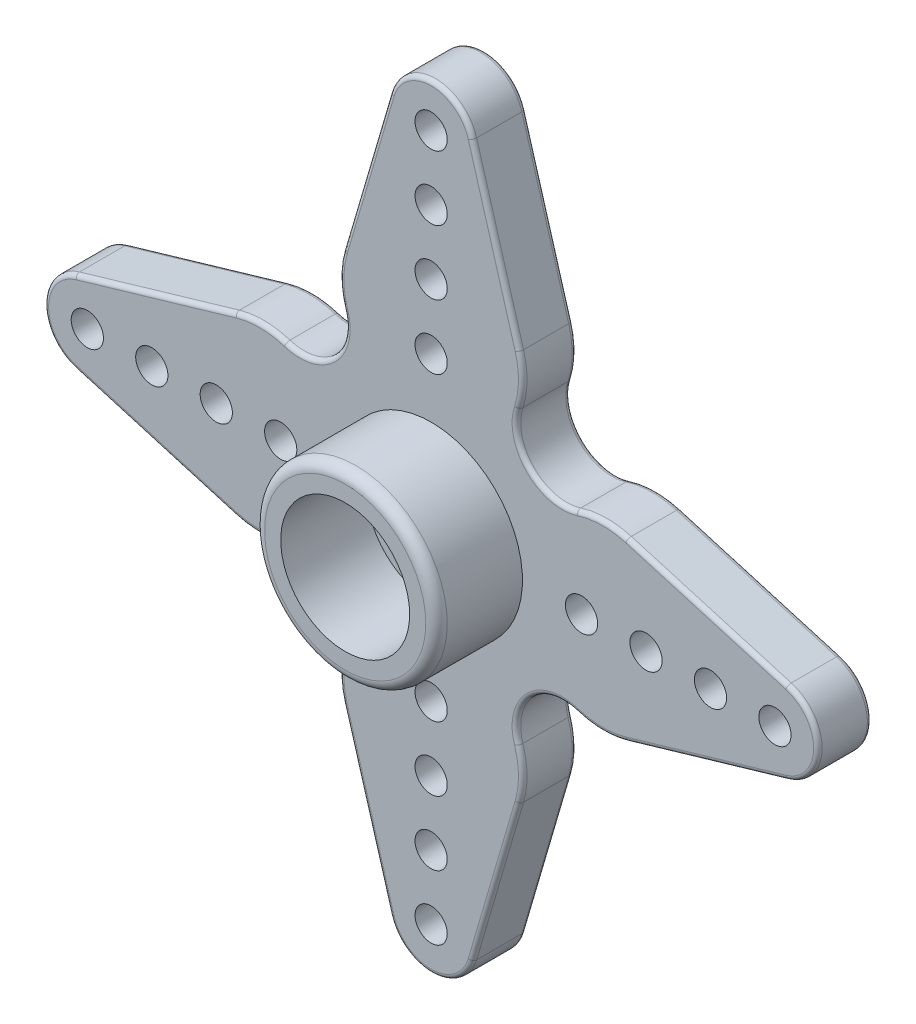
from build123d import *

# Parameters (mm, degrees)
SKETCH1_R           = 0.75
SKETCH1_R_2         = 1.5
BOSS_EXTRUDE1_DEPTH = 2.5
SKETCH2_R           = 4.25
SKETCH2_R_2         = 3
BOSS_EXTRUDE2_DEPTH = 4
SKETCH3_R           = 4.5
CUT_EXTRUDE1_DEPTH  = 0.8
SKETCH4_R           = 3.7
SKETCH4_R_2         = 3.5
BOSS_EXTRUDE3_DEPTH = 1
FILLET2_R           = 0.5
FILLET3_R           = 0.2


with BuildPart() as part:
    # Sketch1 → Boss-Extrude1 (new body)
    with BuildSketch(Plane.XY):
        with BuildLine():
            Line((1.919269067, 16.5625), (4.101564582, 9.116433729))
            ThreePointArc((4.101564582, 9.116433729), (4.262692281, 7.939730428), (4.071201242, 6.767585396))
            ThreePointArc((4.071201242, 6.767585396), (4.596194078, 4.596194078), (6.767585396, 4.071201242))
            ThreePointArc((6.767585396, 4.071201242), (7.939730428, 4.262692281), (9.116433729, 4.101564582))
            Line((9.116433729, 4.101564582), (16.5625, 1.919269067))
            ThreePointArc((16.5625, 1.919269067), (18, 0), (16.5625, -1.919269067))
            Line((16.5625, -1.919269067), (9.116433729, -4.101564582))
            ThreePointArc((9.116433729, -4.101564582), (7.939730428, -4.262692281), (6.767585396, -4.071201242))
            ThreePointArc((6.767585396, -4.071201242), (4.596194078, -4.596194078), (4.071201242, -6.767585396))
            ThreePointArc((4.071201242, -6.767585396), (4.262692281, -7.939730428), (4.101564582, -9.116433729))
            Line((4.101564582, -9.116433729), (1.919269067, -16.5625))
            ThreePointArc((1.919269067, -16.5625), (0, -18), (-1.919269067, -16.5625))
            Line((-1.919269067, -16.5625), (-4.101564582, -9.116433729))
            ThreePointArc((-4.101564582, -9.116433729), (-4.262692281, -7.939730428), (-4.071201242, -6.767585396))
            ThreePointArc((-4.071201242, -6.767585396), (-4.596194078, -4.596194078), (-6.767585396, -4.071201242))
            ThreePointArc((-6.767585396, -4.071201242), (-7.939730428, -4.262692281), (-9.116433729, -4.101564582))
            Line((-9.116433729, -4.101564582), (-16.5625, -1.919269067))
            ThreePointArc((-16.5625, -1.919269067), (-18, 0), (-16.5625, 1.919269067))
            Line((-16.5625, 1.919269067), (-9.116433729, 4.101564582))
            ThreePointArc((-9.116433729, 4.101564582), (-7.939730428, 4.262692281), (-6.767585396, 4.071201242))
            ThreePointArc((-6.767585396, 4.071201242), (-4.596194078, 4.596194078), (-4.071201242, 6.767585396))
            ThreePointArc((-4.071201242, 6.767585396), (-4.262692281, 7.939730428), (-4.101564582, 9.116433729))
            Line((-4.101564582, 9.116433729), (-1.919269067, 16.5625))
            ThreePointArc((-1.919269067, 16.5625), (0, 18), (1.919269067, 16.5625))
        make_face()
        with Locations((0, 7)):
            Circle(SKETCH1_R, mode=Mode.SUBTRACT)
        with Locations((0, 10)):
            Circle(SKETCH1_R, mode=Mode.SUBTRACT)
        with Locations((0, 13)):
            Circle(SKETCH1_R, mode=Mode.SUBTRACT)
        with Locations((0, 16)):
            Circle(SKETCH1_R, mode=Mode.SUBTRACT)
        Circle(SKETCH1_R_2, mode=Mode.SUBTRACT)
        with Locations((16, 0)):
            Circle(SKETCH1_R, mode=Mode.SUBTRACT)
        with Locations((13, 0)):
            Circle(SKETCH1_R, mode=Mode.SUBTRACT)
        with Locations((10, 0)):
            Circle(SKETCH1_R, mode=Mode.SUBTRACT)
        with Locations((7, 0)):
            Circle(SKETCH1_R, mode=Mode.SUBTRACT)
        with Locations((0, -16)):
            Circle(SKETCH1_R, mode=Mode.SUBTRACT)
        with Locations((0, -13)):
            Circle(SKETCH1_R, mode=Mode.SUBTRACT)
        with Locations((0, -10)):
            Circle(SKETCH1_R, mode=Mode.SUBTRACT)
        with Locations((0, -7)):
            Circle(SKETCH1_R, mode=Mode.SUBTRACT)
        with Locations((-16, 0)):
            Circle(SKETCH1_R, mode=Mode.SUBTRACT)
        with Locations((-13, 0)):
            Circle(SKETCH1_R, mode=Mode.SUBTRACT)
        with Locations((-10, 0)):
            Circle(SKETCH1_R, mode=Mode.SUBTRACT)
        with Locations((-7, 0)):
            Circle(SKETCH1_R, mode=Mode.SUBTRACT)
    extrude(amount=BOSS_EXTRUDE1_DEPTH)

    # Sketch2 → Boss-Extrude2 (add)
    with BuildSketch(Plane.XY.offset(2.5)):
        with Locations(Location((0, 0, 0), (0, 0, 180))):
            Circle(SKETCH2_R)
        Circle(SKETCH2_R_2, mode=Mode.SUBTRACT)
    extrude(amount=BOSS_EXTRUDE2_DEPTH)

    # Sketch3 → Cut-Extrude1 (cut)
    with BuildSketch(Plane(origin=(0, 0, 0), x_dir=(-1, 0, 0), z_dir=(0, 0, -1))):
        Circle(SKETCH3_R)
    extrude(amount=-CUT_EXTRUDE1_DEPTH, mode=Mode.SUBTRACT)

    # Sketch4 → Boss-Extrude3 (add)
    with BuildSketch(Plane(origin=(0, 0, 0.8), x_dir=(-1, 0, 0), z_dir=(0, 0, -1))):
        Circle(SKETCH4_R)
        Circle(SKETCH4_R_2, mode=Mode.SUBTRACT)
    extrude(amount=BOSS_EXTRUDE3_DEPTH)

    # Fillet2
    fillet2_edges = [part.edges().sort_by_distance(p)[0] for p in [
        (4.25, 0, 6.5),
    ]]
    fillet(fillet2_edges, radius=FILLET2_R)

    # Fillet3
    fillet3_edges = [part.edges().sort_by_distance(p)[0] for p in [
        (-18, 0, 2.5),
        (-12.839466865, -3.010416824, 2.5),
        (-7.939730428, -4.262692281, 2.5),
        (-4.596194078, -4.596194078, 2.5),
        (-4.596194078, 4.596194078, 0),
        (-4.262692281, 7.939730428, 0),
        (-3.010416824, 12.839466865, 0),
        (0, 18, 0),
        (-4.262692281, -7.939730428, 2.5),
        (3.010416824, 12.839466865, 0),
        (4.262692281, 7.939730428, 0),
        (4.596194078, 4.596194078, 0),
        (7.939730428, 4.262692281, 0),
        (12.839466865, 3.010416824, 0),
        (18, 0, 0),
        (12.839466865, -3.010416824, 0),
        (7.939730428, -4.262692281, 0),
        (-3.010416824, -12.839466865, 2.5),
        (4.596194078, -4.596194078, 0),
        (4.262692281, -7.939730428, 0),
        (3.010416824, -12.839466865, 0),
        (0, -18, 0),
        (-3.010416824, -12.839466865, 0),
        (-4.262692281, -7.939730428, 0),
        (-4.596194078, -4.596194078, 0),
        (0, -18, 2.5),
        (-7.939730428, -4.262692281, 0),
        (-12.839466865, -3.010416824, 0),
        (-18, 0, 0),
        (-12.839466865, 3.010416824, 0),
        (-7.939730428, 4.262692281, 0),
        (3.010416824, -12.839466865, 2.5),
        (4.262692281, -7.939730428, 2.5),
        (4.596194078, -4.596194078, 2.5),
        (-7.939730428, 4.262692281, 2.5),
        (7.939730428, -4.262692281, 2.5),
        (12.839466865, -3.010416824, 2.5),
        (18, 0, 2.5),
        (12.839466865, 3.010416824, 2.5),
        (7.939730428, 4.262692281, 2.5),
        (4.596194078, 4.596194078, 2.5),
        (4.262692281, 7.939730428, 2.5),
        (3.010416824, 12.839466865, 2.5),
        (0, 18, 2.5),
        (-3.010416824, 12.839466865, 2.5),
        (-12.839466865, 3.010416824, 2.5),
        (-4.262692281, 7.939730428, 2.5),
        (-4.596194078, 4.596194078, 2.5),
    ]]
    fillet(fillet3_edges, radius=FILLET3_R)


solid = part.part
